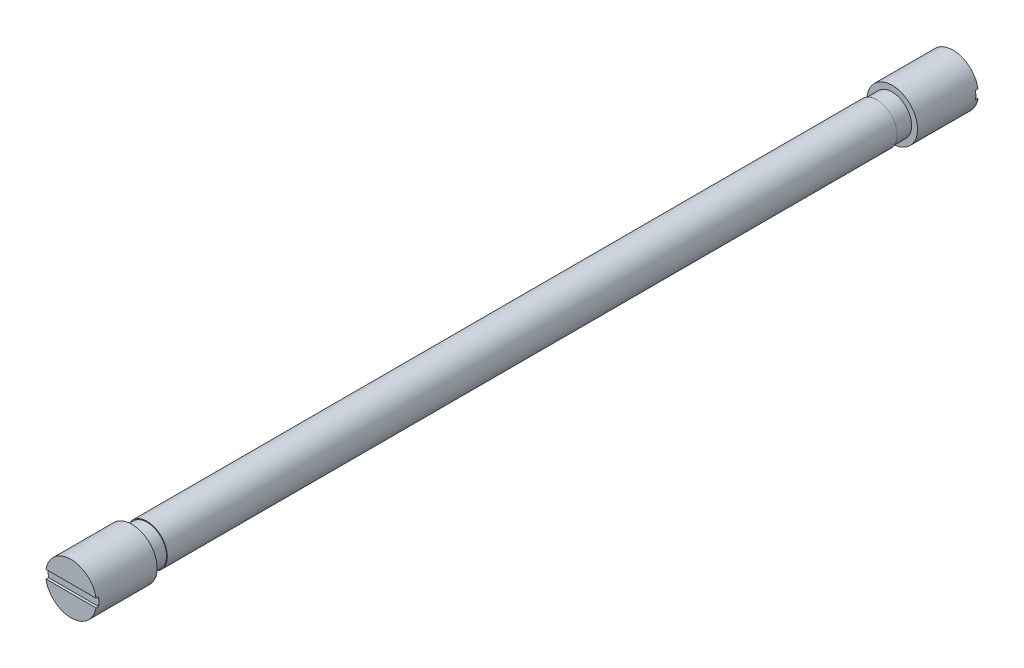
ISO-10303-21;
HEADER;
FILE_DESCRIPTION(('STEP AP214'),'2;1');
FILE_NAME('part.step','',(''),(''),'','','');
FILE_SCHEMA(('AUTOMOTIVE_DESIGN { 1 0 10303 214 1 1 1 1 }'));
ENDSEC;
DATA;
#1=APPLICATION_CONTEXT('core data for automotive mechanical design processes');
#2=APPLICATION_PROTOCOL_DEFINITION('international standard','automotive_design',2000,#1);
#3=PRODUCT_CONTEXT('',#1,'mechanical');
#4=PRODUCT('Part','Part','',(#3));
#5=PRODUCT_RELATED_PRODUCT_CATEGORY('part','',(#4));
#6=PRODUCT_DEFINITION_FORMATION('','',#4);
#7=PRODUCT_DEFINITION_CONTEXT('part definition',#1,'design');
#8=PRODUCT_DEFINITION('design','',#6,#7);
#9=PRODUCT_DEFINITION_SHAPE('','',#8);
#10=(LENGTH_UNIT() NAMED_UNIT(*) SI_UNIT(.MILLI.,.METRE.));
#11=(NAMED_UNIT(*) PLANE_ANGLE_UNIT() SI_UNIT($,.RADIAN.));
#12=(NAMED_UNIT(*) SI_UNIT($,.STERADIAN.) SOLID_ANGLE_UNIT());
#13=UNCERTAINTY_MEASURE_WITH_UNIT(LENGTH_MEASURE(1.E-05),#10,'distance_accuracy_value','');
#14=(GEOMETRIC_REPRESENTATION_CONTEXT(3) GLOBAL_UNCERTAINTY_ASSIGNED_CONTEXT((#13)) GLOBAL_UNIT_ASSIGNED_CONTEXT((#10,
#11,#12)) REPRESENTATION_CONTEXT('',''));
#15=CARTESIAN_POINT('',(0.,0.,0.));
#16=DIRECTION('',(0.,0.,1.));
#17=DIRECTION('',(1.,0.,0.));
#18=AXIS2_PLACEMENT_3D('',#15,#16,#17);
#19=CARTESIAN_POINT('',(0.,0.,87.));
#20=DIRECTION('',(0.,0.,1.));
#21=DIRECTION('',(1.,0.,0.));
#22=AXIS2_PLACEMENT_3D('',#19,#20,#21);
#23=PLANE('',#22);
#24=CARTESIAN_POINT('',(0.,0.,87.));
#25=DIRECTION('',(0.,0.,1.));
#26=DIRECTION('',(1.,0.,0.));
#27=AXIS2_PLACEMENT_3D('',#24,#25,#26);
#28=CIRCLE('',#27,5.);
#29=CARTESIAN_POINT('',(4.93036641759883,0.831556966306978,87.));
#30=VERTEX_POINT('',#29);
#31=CARTESIAN_POINT('',(-4.93036641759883,0.831556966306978,87.));
#32=VERTEX_POINT('',#31);
#33=EDGE_CURVE('E121',#30,#32,#28,.T.);
#34=ORIENTED_EDGE('',*,*,#33,.T.);
#35=DIRECTION('',(1.,0.,0.));
#36=VECTOR('',#35,1.);
#37=CARTESIAN_POINT('',(5.83331006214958,0.831556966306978,87.));
#38=LINE('',#37,#36);
#39=EDGE_CURVE('E112',#32,#30,#38,.T.);
#40=ORIENTED_EDGE('',*,*,#39,.T.);
#41=EDGE_LOOP('',(#34,#40));
#42=FACE_BOUND('',#41,.T.);
#43=ADVANCED_FACE('F40',(#42),#23,.T.);
#44=CARTESIAN_POINT('',(-4.93036641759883,-0.831556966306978,87.));
#45=VERTEX_POINT('',#44);
#46=CARTESIAN_POINT('',(4.93036641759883,-0.831556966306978,87.));
#47=VERTEX_POINT('',#46);
#48=EDGE_CURVE('E118',#45,#47,#28,.T.);
#49=ORIENTED_EDGE('',*,*,#48,.T.);
#50=DIRECTION('',(-1.,0.,0.));
#51=VECTOR('',#50,1.);
#52=CARTESIAN_POINT('',(5.83331006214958,-0.831556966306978,87.));
#53=LINE('',#52,#51);
#54=EDGE_CURVE('E102',#47,#45,#53,.T.);
#55=ORIENTED_EDGE('',*,*,#54,.T.);
#56=EDGE_LOOP('',(#49,#55));
#57=FACE_BOUND('',#56,.T.);
#58=ADVANCED_FACE('F120',(#57),#23,.T.);
#59=CARTESIAN_POINT('',(0.,0.,51.));
#60=DIRECTION('',(0.,0.,1.));
#61=DIRECTION('',(1.,0.,0.));
#62=AXIS2_PLACEMENT_3D('',#59,#60,#61);
#63=CYLINDRICAL_SURFACE('',#62,5.);
#64=CARTESIAN_POINT('',(0.,0.,75.));
#65=DIRECTION('',(0.,0.,1.));
#66=DIRECTION('',(1.,0.,0.));
#67=AXIS2_PLACEMENT_3D('',#64,#65,#66);
#68=CIRCLE('',#67,5.);
#69=CARTESIAN_POINT('',(5.,0.,75.));
#70=VERTEX_POINT('',#69);
#71=EDGE_CURVE('E122',#70,#70,#68,.T.);
#72=ORIENTED_EDGE('',*,*,#71,.T.);
#73=EDGE_LOOP('',(#72));
#74=FACE_BOUND('',#73,.T.);
#75=DIRECTION('',(0.,0.,1.));
#76=VECTOR('',#75,1.);
#77=CARTESIAN_POINT('',(4.93036641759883,0.831556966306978,51.));
#78=LINE('',#77,#76);
#79=CARTESIAN_POINT('',(4.93036641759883,0.831556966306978,86.5));
#80=VERTEX_POINT('',#79);
#81=EDGE_CURVE('E11',#80,#30,#78,.T.);
#82=ORIENTED_EDGE('',*,*,#81,.F.);
#83=CARTESIAN_POINT('',(0.,0.,86.5));
#84=DIRECTION('',(0.,0.,-1.));
#85=DIRECTION('',(-1.,0.,0.));
#86=AXIS2_PLACEMENT_3D('',#83,#84,#85);
#87=CIRCLE('',#86,5.);
#88=CARTESIAN_POINT('',(4.93036641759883,-0.831556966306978,86.5));
#89=VERTEX_POINT('',#88);
#90=EDGE_CURVE('E119',#80,#89,#87,.T.);
#91=ORIENTED_EDGE('',*,*,#90,.T.);
#92=DIRECTION('',(0.,0.,1.));
#93=VECTOR('',#92,1.);
#94=CARTESIAN_POINT('',(4.93036641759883,-0.831556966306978,51.));
#95=LINE('',#94,#93);
#96=EDGE_CURVE('E47',#47,#89,#95,.F.);
#97=ORIENTED_EDGE('',*,*,#96,.F.);
#98=ORIENTED_EDGE('',*,*,#48,.F.);
#99=DIRECTION('',(0.,0.,1.));
#100=VECTOR('',#99,1.);
#101=CARTESIAN_POINT('',(-4.93036641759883,-0.831556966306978,51.));
#102=LINE('',#101,#100);
#103=CARTESIAN_POINT('',(-4.93036641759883,-0.831556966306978,86.5));
#104=VERTEX_POINT('',#103);
#105=EDGE_CURVE('E108',#104,#45,#102,.T.);
#106=ORIENTED_EDGE('',*,*,#105,.F.);
#107=CARTESIAN_POINT('',(-4.93036641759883,0.831556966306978,86.5));
#108=VERTEX_POINT('',#107);
#109=EDGE_CURVE('E143',#104,#108,#87,.T.);
#110=ORIENTED_EDGE('',*,*,#109,.T.);
#111=DIRECTION('',(0.,0.,1.));
#112=VECTOR('',#111,1.);
#113=CARTESIAN_POINT('',(-4.93036641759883,0.831556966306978,51.));
#114=LINE('',#113,#112);
#115=EDGE_CURVE('E147',#32,#108,#114,.F.);
#116=ORIENTED_EDGE('',*,*,#115,.F.);
#117=ORIENTED_EDGE('',*,*,#33,.F.);
#118=EDGE_LOOP('',(#82,#91,#97,#98,#106,#110,#116,#117));
#119=FACE_BOUND('',#118,.T.);
#120=ADVANCED_FACE('F117',(#74,#119),#63,.T.);
#121=CARTESIAN_POINT('',(0.,0.,-87.));
#122=DIRECTION('',(0.,0.,1.));
#123=DIRECTION('',(1.,0.,0.));
#124=AXIS2_PLACEMENT_3D('',#121,#122,#123);
#125=PLANE('',#124);
#126=CARTESIAN_POINT('',(0.,0.,-87.));
#127=DIRECTION('',(0.,0.,1.));
#128=DIRECTION('',(1.,0.,0.));
#129=AXIS2_PLACEMENT_3D('',#126,#127,#128);
#130=CIRCLE('',#129,5.);
#131=CARTESIAN_POINT('',(-4.93036641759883,-0.831556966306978,-87.));
#132=VERTEX_POINT('',#131);
#133=CARTESIAN_POINT('',(4.93036641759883,-0.831556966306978,-87.));
#134=VERTEX_POINT('',#133);
#135=EDGE_CURVE('E185',#132,#134,#130,.T.);
#136=ORIENTED_EDGE('',*,*,#135,.F.);
#137=DIRECTION('',(-1.,0.,0.));
#138=VECTOR('',#137,1.);
#139=CARTESIAN_POINT('',(5.83331006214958,-0.831556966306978,-87.));
#140=LINE('',#139,#138);
#141=EDGE_CURVE('E161',#134,#132,#140,.T.);
#142=ORIENTED_EDGE('',*,*,#141,.F.);
#143=EDGE_LOOP('',(#136,#142));
#144=FACE_BOUND('',#143,.T.);
#145=ADVANCED_FACE('F201',(#144),#125,.F.);
#146=CARTESIAN_POINT('',(4.93036641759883,0.831556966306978,-87.));
#147=VERTEX_POINT('',#146);
#148=CARTESIAN_POINT('',(-4.93036641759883,0.831556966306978,-87.));
#149=VERTEX_POINT('',#148);
#150=EDGE_CURVE('E134',#147,#149,#130,.T.);
#151=ORIENTED_EDGE('',*,*,#150,.F.);
#152=DIRECTION('',(1.,0.,0.));
#153=VECTOR('',#152,1.);
#154=CARTESIAN_POINT('',(5.83331006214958,0.831556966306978,-87.));
#155=LINE('',#154,#153);
#156=EDGE_CURVE('E156',#149,#147,#155,.T.);
#157=ORIENTED_EDGE('',*,*,#156,.F.);
#158=EDGE_LOOP('',(#151,#157));
#159=FACE_BOUND('',#158,.T.);
#160=ADVANCED_FACE('F210',(#159),#125,.F.);
#161=CARTESIAN_POINT('',(0.,0.,51.));
#162=DIRECTION('',(0.,0.,1.));
#163=DIRECTION('',(1.,0.,0.));
#164=AXIS2_PLACEMENT_3D('',#161,#162,#163);
#165=CYLINDRICAL_SURFACE('',#164,5.);
#166=DIRECTION('',(0.,0.,1.));
#167=VECTOR('',#166,1.);
#168=CARTESIAN_POINT('',(-4.93036641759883,-0.831556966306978,51.));
#169=LINE('',#168,#167);
#170=CARTESIAN_POINT('',(-4.93036641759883,-0.831556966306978,-86.5));
#171=VERTEX_POINT('',#170);
#172=EDGE_CURVE('E141',#132,#171,#169,.T.);
#173=ORIENTED_EDGE('',*,*,#172,.F.);
#174=ORIENTED_EDGE('',*,*,#135,.T.);
#175=DIRECTION('',(0.,0.,1.));
#176=VECTOR('',#175,1.);
#177=CARTESIAN_POINT('',(4.93036641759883,-0.831556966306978,51.));
#178=LINE('',#177,#176);
#179=CARTESIAN_POINT('',(4.93036641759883,-0.831556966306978,-86.5));
#180=VERTEX_POINT('',#179);
#181=EDGE_CURVE('E137',#180,#134,#178,.F.);
#182=ORIENTED_EDGE('',*,*,#181,.F.);
#183=CARTESIAN_POINT('',(0.,0.,-86.5));
#184=DIRECTION('',(0.,0.,1.));
#185=DIRECTION('',(1.,0.,0.));
#186=AXIS2_PLACEMENT_3D('',#183,#184,#185);
#187=CIRCLE('',#186,5.);
#188=CARTESIAN_POINT('',(4.93036641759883,0.831556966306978,-86.5));
#189=VERTEX_POINT('',#188);
#190=EDGE_CURVE('E131',#189,#180,#187,.F.);
#191=ORIENTED_EDGE('',*,*,#190,.F.);
#192=DIRECTION('',(0.,0.,1.));
#193=VECTOR('',#192,1.);
#194=CARTESIAN_POINT('',(4.93036641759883,0.831556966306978,51.));
#195=LINE('',#194,#193);
#196=EDGE_CURVE('E133',#147,#189,#195,.T.);
#197=ORIENTED_EDGE('',*,*,#196,.F.);
#198=ORIENTED_EDGE('',*,*,#150,.T.);
#199=DIRECTION('',(0.,0.,1.));
#200=VECTOR('',#199,1.);
#201=CARTESIAN_POINT('',(-4.93036641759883,0.831556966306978,51.));
#202=LINE('',#201,#200);
#203=CARTESIAN_POINT('',(-4.93036641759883,0.831556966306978,-86.5));
#204=VERTEX_POINT('',#203);
#205=EDGE_CURVE('E139',#204,#149,#202,.F.);
#206=ORIENTED_EDGE('',*,*,#205,.F.);
#207=EDGE_CURVE('E135',#171,#204,#187,.F.);
#208=ORIENTED_EDGE('',*,*,#207,.F.);
#209=EDGE_LOOP('',(#173,#174,#182,#191,#197,#198,#206,#208));
#210=FACE_BOUND('',#209,.T.);
#211=CARTESIAN_POINT('',(0.,0.,-75.));
#212=DIRECTION('',(0.,0.,1.));
#213=DIRECTION('',(1.,0.,0.));
#214=AXIS2_PLACEMENT_3D('',#211,#212,#213);
#215=CIRCLE('',#214,5.);
#216=CARTESIAN_POINT('',(5.,0.,-75.));
#217=VERTEX_POINT('',#216);
#218=EDGE_CURVE('E183',#217,#217,#215,.T.);
#219=ORIENTED_EDGE('',*,*,#218,.F.);
#220=EDGE_LOOP('',(#219));
#221=FACE_BOUND('',#220,.T.);
#222=ADVANCED_FACE('F195',(#210,#221),#165,.T.);
#223=CARTESIAN_POINT('',(0.,0.,-75.));
#224=DIRECTION('',(0.,0.,1.));
#225=DIRECTION('',(1.,0.,0.));
#226=AXIS2_PLACEMENT_3D('',#223,#224,#225);
#227=PLANE('',#226);
#228=ORIENTED_EDGE('',*,*,#218,.T.);
#229=EDGE_LOOP('',(#228));
#230=FACE_BOUND('',#229,.T.);
#231=CARTESIAN_POINT('',(0.,0.,-75.));
#232=DIRECTION('',(0.,0.,1.));
#233=DIRECTION('',(1.,0.,0.));
#234=AXIS2_PLACEMENT_3D('',#231,#232,#233);
#235=CIRCLE('',#234,3.85);
#236=CARTESIAN_POINT('',(3.85,0.,-75.));
#237=VERTEX_POINT('',#236);
#238=EDGE_CURVE('E180',#237,#237,#235,.T.);
#239=ORIENTED_EDGE('',*,*,#238,.F.);
#240=EDGE_LOOP('',(#239));
#241=FACE_BOUND('',#240,.T.);
#242=ADVANCED_FACE('F218',(#230,#241),#227,.T.);
#243=CARTESIAN_POINT('',(0.,0.,51.));
#244=DIRECTION('',(0.,0.,1.));
#245=DIRECTION('',(1.,0.,0.));
#246=AXIS2_PLACEMENT_3D('',#243,#244,#245);
#247=CYLINDRICAL_SURFACE('',#246,3.85);
#248=ORIENTED_EDGE('',*,*,#238,.T.);
#249=EDGE_LOOP('',(#248));
#250=FACE_BOUND('',#249,.T.);
#251=CARTESIAN_POINT('',(0.,0.,-72.));
#252=DIRECTION('',(0.,0.,1.));
#253=DIRECTION('',(1.,0.,0.));
#254=AXIS2_PLACEMENT_3D('',#251,#252,#253);
#255=CIRCLE('',#254,3.85);
#256=CARTESIAN_POINT('',(3.85,0.,-72.));
#257=VERTEX_POINT('',#256);
#258=EDGE_CURVE('E177',#257,#257,#255,.T.);
#259=ORIENTED_EDGE('',*,*,#258,.F.);
#260=EDGE_LOOP('',(#259));
#261=FACE_BOUND('',#260,.T.);
#262=ADVANCED_FACE('F334',(#250,#261),#247,.T.);
#263=CARTESIAN_POINT('',(0.,0.,-72.));
#264=DIRECTION('',(0.,0.,1.));
#265=DIRECTION('',(1.,0.,0.));
#266=AXIS2_PLACEMENT_3D('',#263,#264,#265);
#267=PLANE('',#266);
#268=CARTESIAN_POINT('',(0.,0.,-72.));
#269=DIRECTION('',(0.,0.,1.));
#270=DIRECTION('',(1.,0.,0.));
#271=AXIS2_PLACEMENT_3D('',#268,#269,#270);
#272=CIRCLE('',#271,4.);
#273=CARTESIAN_POINT('',(4.,0.,-72.));
#274=VERTEX_POINT('',#273);
#275=EDGE_CURVE('E174',#274,#274,#272,.T.);
#276=ORIENTED_EDGE('',*,*,#275,.F.);
#277=EDGE_LOOP('',(#276));
#278=FACE_BOUND('',#277,.T.);
#279=ORIENTED_EDGE('',*,*,#258,.T.);
#280=EDGE_LOOP('',(#279));
#281=FACE_BOUND('',#280,.T.);
#282=ADVANCED_FACE('F330',(#278,#281),#267,.F.);
#283=CARTESIAN_POINT('',(0.,0.,51.));
#284=DIRECTION('',(0.,0.,1.));
#285=DIRECTION('',(1.,0.,0.));
#286=AXIS2_PLACEMENT_3D('',#283,#284,#285);
#287=CYLINDRICAL_SURFACE('',#286,4.);
#288=ORIENTED_EDGE('',*,*,#275,.T.);
#289=EDGE_LOOP('',(#288));
#290=FACE_BOUND('',#289,.T.);
#291=CARTESIAN_POINT('',(0.,0.,72.));
#292=DIRECTION('',(0.,0.,1.));
#293=DIRECTION('',(1.,0.,0.));
#294=AXIS2_PLACEMENT_3D('',#291,#292,#293);
#295=CIRCLE('',#294,4.);
#296=CARTESIAN_POINT('',(4.,0.,72.));
#297=VERTEX_POINT('',#296);
#298=EDGE_CURVE('E171',#297,#297,#295,.T.);
#299=ORIENTED_EDGE('',*,*,#298,.F.);
#300=EDGE_LOOP('',(#299));
#301=FACE_BOUND('',#300,.T.);
#302=ADVANCED_FACE('F326',(#290,#301),#287,.T.);
#303=CARTESIAN_POINT('',(0.,0.,72.));
#304=DIRECTION('',(0.,0.,1.));
#305=DIRECTION('',(1.,0.,0.));
#306=AXIS2_PLACEMENT_3D('',#303,#304,#305);
#307=PLANE('',#306);
#308=ORIENTED_EDGE('',*,*,#298,.T.);
#309=EDGE_LOOP('',(#308));
#310=FACE_BOUND('',#309,.T.);
#311=CARTESIAN_POINT('',(0.,0.,72.));
#312=DIRECTION('',(0.,0.,1.));
#313=DIRECTION('',(1.,0.,0.));
#314=AXIS2_PLACEMENT_3D('',#311,#312,#313);
#315=CIRCLE('',#314,3.85);
#316=CARTESIAN_POINT('',(3.85,0.,72.));
#317=VERTEX_POINT('',#316);
#318=EDGE_CURVE('E168',#317,#317,#315,.T.);
#319=ORIENTED_EDGE('',*,*,#318,.F.);
#320=EDGE_LOOP('',(#319));
#321=FACE_BOUND('',#320,.T.);
#322=ADVANCED_FACE('F322',(#310,#321),#307,.T.);
#323=CARTESIAN_POINT('',(0.,0.,51.));
#324=DIRECTION('',(0.,0.,1.));
#325=DIRECTION('',(1.,0.,0.));
#326=AXIS2_PLACEMENT_3D('',#323,#324,#325);
#327=CYLINDRICAL_SURFACE('',#326,3.85);
#328=CARTESIAN_POINT('',(0.,0.,75.));
#329=DIRECTION('',(0.,0.,1.));
#330=DIRECTION('',(1.,0.,0.));
#331=AXIS2_PLACEMENT_3D('',#328,#329,#330);
#332=CIRCLE('',#331,3.85);
#333=CARTESIAN_POINT('',(3.85,0.,75.));
#334=VERTEX_POINT('',#333);
#335=EDGE_CURVE('E125',#334,#334,#332,.T.);
#336=ORIENTED_EDGE('',*,*,#335,.F.);
#337=EDGE_LOOP('',(#336));
#338=FACE_BOUND('',#337,.T.);
#339=ORIENTED_EDGE('',*,*,#318,.T.);
#340=EDGE_LOOP('',(#339));
#341=FACE_BOUND('',#340,.T.);
#342=ADVANCED_FACE('F222',(#338,#341),#327,.T.);
#343=CARTESIAN_POINT('',(0.,0.,75.));
#344=DIRECTION('',(0.,0.,1.));
#345=DIRECTION('',(1.,0.,0.));
#346=AXIS2_PLACEMENT_3D('',#343,#344,#345);
#347=PLANE('',#346);
#348=ORIENTED_EDGE('',*,*,#335,.T.);
#349=EDGE_LOOP('',(#348));
#350=FACE_BOUND('',#349,.T.);
#351=ORIENTED_EDGE('',*,*,#71,.F.);
#352=EDGE_LOOP('',(#351));
#353=FACE_BOUND('',#352,.T.);
#354=ADVANCED_FACE('F213',(#350,#353),#347,.F.);
#355=CARTESIAN_POINT('',(5.83331006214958,-0.831556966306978,-86.5));
#356=DIRECTION('',(0.,-1.,0.));
#357=DIRECTION('',(0.,0.,-1.));
#358=AXIS2_PLACEMENT_3D('',#355,#356,#357);
#359=PLANE('',#358);
#360=ORIENTED_EDGE('',*,*,#181,.T.);
#361=ORIENTED_EDGE('',*,*,#141,.T.);
#362=ORIENTED_EDGE('',*,*,#172,.T.);
#363=DIRECTION('',(-1.,0.,0.));
#364=VECTOR('',#363,1.);
#365=CARTESIAN_POINT('',(5.83331006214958,-0.831556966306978,-86.5));
#366=LINE('',#365,#364);
#367=EDGE_CURVE('E127',#180,#171,#366,.T.);
#368=ORIENTED_EDGE('',*,*,#367,.F.);
#369=EDGE_LOOP('',(#360,#361,#362,#368));
#370=FACE_BOUND('',#369,.T.);
#371=ADVANCED_FACE('F203',(#370),#359,.F.);
#372=CARTESIAN_POINT('',(5.83331006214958,0.831556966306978,-86.5));
#373=DIRECTION('',(0.,1.,0.));
#374=DIRECTION('',(0.,0.,1.));
#375=AXIS2_PLACEMENT_3D('',#372,#373,#374);
#376=PLANE('',#375);
#377=ORIENTED_EDGE('',*,*,#205,.T.);
#378=ORIENTED_EDGE('',*,*,#156,.T.);
#379=ORIENTED_EDGE('',*,*,#196,.T.);
#380=DIRECTION('',(1.,0.,0.));
#381=VECTOR('',#380,1.);
#382=CARTESIAN_POINT('',(5.83331006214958,0.831556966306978,-86.5));
#383=LINE('',#382,#381);
#384=EDGE_CURVE('E62',#204,#189,#383,.T.);
#385=ORIENTED_EDGE('',*,*,#384,.F.);
#386=EDGE_LOOP('',(#377,#378,#379,#385));
#387=FACE_BOUND('',#386,.T.);
#388=ADVANCED_FACE('F208',(#387),#376,.F.);
#389=CARTESIAN_POINT('',(0.,0.,-86.5));
#390=DIRECTION('',(0.,0.,1.));
#391=DIRECTION('',(1.,0.,0.));
#392=AXIS2_PLACEMENT_3D('',#389,#390,#391);
#393=PLANE('',#392);
#394=ORIENTED_EDGE('',*,*,#207,.T.);
#395=ORIENTED_EDGE('',*,*,#384,.T.);
#396=ORIENTED_EDGE('',*,*,#190,.T.);
#397=ORIENTED_EDGE('',*,*,#367,.T.);
#398=EDGE_LOOP('',(#394,#395,#396,#397));
#399=FACE_BOUND('',#398,.T.);
#400=ADVANCED_FACE('F205',(#399),#393,.F.);
#401=CARTESIAN_POINT('',(5.83331006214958,0.831556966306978,86.5));
#402=DIRECTION('',(0.,-1.,0.));
#403=DIRECTION('',(0.,0.,-1.));
#404=AXIS2_PLACEMENT_3D('',#401,#402,#403);
#405=PLANE('',#404);
#406=ORIENTED_EDGE('',*,*,#81,.T.);
#407=ORIENTED_EDGE('',*,*,#39,.F.);
#408=ORIENTED_EDGE('',*,*,#115,.T.);
#409=DIRECTION('',(1.,0.,0.));
#410=VECTOR('',#409,1.);
#411=CARTESIAN_POINT('',(5.83331006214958,0.831556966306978,86.5));
#412=LINE('',#411,#410);
#413=EDGE_CURVE('E54',#108,#80,#412,.T.);
#414=ORIENTED_EDGE('',*,*,#413,.T.);
#415=EDGE_LOOP('',(#406,#407,#408,#414));
#416=FACE_BOUND('',#415,.T.);
#417=ADVANCED_FACE('F150',(#416),#405,.T.);
#418=CARTESIAN_POINT('',(5.83331006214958,-0.831556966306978,86.5));
#419=DIRECTION('',(0.,1.,0.));
#420=DIRECTION('',(0.,0.,1.));
#421=AXIS2_PLACEMENT_3D('',#418,#419,#420);
#422=PLANE('',#421);
#423=ORIENTED_EDGE('',*,*,#105,.T.);
#424=ORIENTED_EDGE('',*,*,#54,.F.);
#425=ORIENTED_EDGE('',*,*,#96,.T.);
#426=DIRECTION('',(-1.,0.,0.));
#427=VECTOR('',#426,1.);
#428=CARTESIAN_POINT('',(5.83331006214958,-0.831556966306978,86.5));
#429=LINE('',#428,#427);
#430=EDGE_CURVE('E154',#89,#104,#429,.T.);
#431=ORIENTED_EDGE('',*,*,#430,.T.);
#432=EDGE_LOOP('',(#423,#424,#425,#431));
#433=FACE_BOUND('',#432,.T.);
#434=ADVANCED_FACE('F104',(#433),#422,.T.);
#435=CARTESIAN_POINT('',(0.,0.,86.5));
#436=DIRECTION('',(0.,0.,-1.));
#437=DIRECTION('',(1.,0.,0.));
#438=AXIS2_PLACEMENT_3D('',#435,#436,#437);
#439=PLANE('',#438);
#440=ORIENTED_EDGE('',*,*,#413,.F.);
#441=ORIENTED_EDGE('',*,*,#109,.F.);
#442=ORIENTED_EDGE('',*,*,#430,.F.);
#443=ORIENTED_EDGE('',*,*,#90,.F.);
#444=EDGE_LOOP('',(#440,#441,#442,#443));
#445=FACE_BOUND('',#444,.T.);
#446=ADVANCED_FACE('F153',(#445),#439,.F.);
#447=CLOSED_SHELL('',(#43,#58,#120,#145,#160,#222,#242,#262,#282,#302,#322,#342,#354,#371,#388,
#400,#417,#434,#446));
#448=MANIFOLD_SOLID_BREP('B2',#447);
#449=ADVANCED_BREP_SHAPE_REPRESENTATION('',(#18,#448),#14);
#450=SHAPE_DEFINITION_REPRESENTATION(#9,#449);
ENDSEC;
END-ISO-10303-21;
